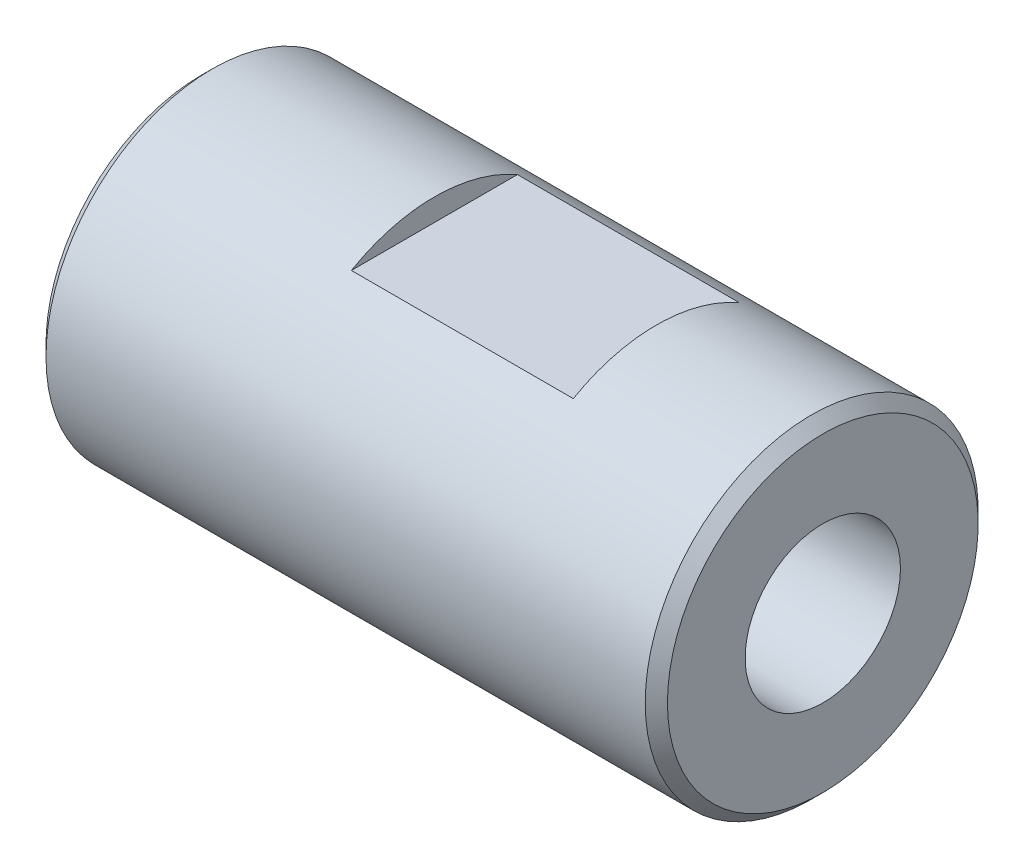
ISO-10303-21;
HEADER;
FILE_DESCRIPTION(('STEP AP214'),'2;1');
FILE_NAME('part.step','',(''),(''),'','','');
FILE_SCHEMA(('AUTOMOTIVE_DESIGN { 1 0 10303 214 1 1 1 1 }'));
ENDSEC;
DATA;
#1=APPLICATION_CONTEXT('core data for automotive mechanical design processes');
#2=APPLICATION_PROTOCOL_DEFINITION('international standard','automotive_design',2000,#1);
#3=PRODUCT_CONTEXT('',#1,'mechanical');
#4=PRODUCT('Part','Part','',(#3));
#5=PRODUCT_RELATED_PRODUCT_CATEGORY('part','',(#4));
#6=PRODUCT_DEFINITION_FORMATION('','',#4);
#7=PRODUCT_DEFINITION_CONTEXT('part definition',#1,'design');
#8=PRODUCT_DEFINITION('design','',#6,#7);
#9=PRODUCT_DEFINITION_SHAPE('','',#8);
#10=(LENGTH_UNIT() NAMED_UNIT(*) SI_UNIT(.MILLI.,.METRE.));
#11=(NAMED_UNIT(*) PLANE_ANGLE_UNIT() SI_UNIT($,.RADIAN.));
#12=(NAMED_UNIT(*) SI_UNIT($,.STERADIAN.) SOLID_ANGLE_UNIT());
#13=UNCERTAINTY_MEASURE_WITH_UNIT(LENGTH_MEASURE(1.E-05),#10,'distance_accuracy_value','');
#14=(GEOMETRIC_REPRESENTATION_CONTEXT(3) GLOBAL_UNCERTAINTY_ASSIGNED_CONTEXT((#13)) GLOBAL_UNIT_ASSIGNED_CONTEXT((#10,
#11,#12)) REPRESENTATION_CONTEXT('',''));
#15=CARTESIAN_POINT('',(0.,0.,0.));
#16=DIRECTION('',(0.,0.,1.));
#17=DIRECTION('',(1.,0.,0.));
#18=AXIS2_PLACEMENT_3D('',#15,#16,#17);
#19=CARTESIAN_POINT('',(-14.6311083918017,0.,0.));
#20=DIRECTION('',(-1.,0.,0.));
#21=DIRECTION('',(0.,0.,1.));
#22=AXIS2_PLACEMENT_3D('',#19,#20,#21);
#23=CYLINDRICAL_SURFACE('',#22,8.5);
#24=CARTESIAN_POINT('',(32.,0.,0.));
#25=DIRECTION('',(-1.,0.,0.));
#26=DIRECTION('',(0.,0.,1.));
#27=AXIS2_PLACEMENT_3D('',#24,#25,#26);
#28=CIRCLE('',#27,8.5);
#29=CARTESIAN_POINT('',(32.,0.,8.5));
#30=VERTEX_POINT('',#29);
#31=EDGE_CURVE('E19',#30,#30,#28,.F.);
#32=ORIENTED_EDGE('',*,*,#31,.T.);
#33=EDGE_LOOP('',(#32));
#34=FACE_BOUND('',#33,.T.);
#35=CARTESIAN_POINT('',(24.,0.,0.));
#36=DIRECTION('',(-1.,0.,0.));
#37=DIRECTION('',(0.,0.,1.));
#38=AXIS2_PLACEMENT_3D('',#35,#36,#37);
#39=CIRCLE('',#38,8.5);
#40=CARTESIAN_POINT('',(24.,0.,8.5));
#41=VERTEX_POINT('',#40);
#42=EDGE_CURVE('E96',#41,#41,#39,.T.);
#43=ORIENTED_EDGE('',*,*,#42,.T.);
#44=EDGE_LOOP('',(#43));
#45=FACE_BOUND('',#44,.T.);
#46=ADVANCED_FACE('F16',(#34,#45),#23,.F.);
#47=CARTESIAN_POINT('',(32.,8.5,0.));
#48=DIRECTION('',(1.,0.,0.));
#49=DIRECTION('',(0.,0.,-1.));
#50=AXIS2_PLACEMENT_3D('',#47,#48,#49);
#51=PLANE('',#50);
#52=ORIENTED_EDGE('',*,*,#31,.F.);
#53=EDGE_LOOP('',(#52));
#54=FACE_BOUND('',#53,.T.);
#55=CARTESIAN_POINT('',(32.,0.,0.));
#56=DIRECTION('',(1.,0.,0.));
#57=DIRECTION('',(0.,0.,-1.));
#58=AXIS2_PLACEMENT_3D('',#55,#56,#57);
#59=CIRCLE('',#58,6.99999999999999);
#60=CARTESIAN_POINT('',(32.,0.,-6.99999999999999));
#61=VERTEX_POINT('',#60);
#62=EDGE_CURVE('E94',#61,#61,#59,.T.);
#63=ORIENTED_EDGE('',*,*,#62,.T.);
#64=EDGE_LOOP('',(#63));
#65=FACE_BOUND('',#64,.T.);
#66=ADVANCED_FACE('F104',(#54,#65),#51,.F.);
#67=CARTESIAN_POINT('',(24.,0.,0.));
#68=DIRECTION('',(-1.,0.,0.));
#69=DIRECTION('',(0.,0.,1.));
#70=AXIS2_PLACEMENT_3D('',#67,#68,#69);
#71=PLANE('',#70);
#72=ORIENTED_EDGE('',*,*,#42,.F.);
#73=EDGE_LOOP('',(#72));
#74=FACE_BOUND('',#73,.T.);
#75=CARTESIAN_POINT('',(24.,0.,0.));
#76=DIRECTION('',(-1.,0.,0.));
#77=DIRECTION('',(0.,0.,1.));
#78=AXIS2_PLACEMENT_3D('',#75,#76,#77);
#79=CIRCLE('',#78,7.25);
#80=CARTESIAN_POINT('',(24.,0.,7.25));
#81=VERTEX_POINT('',#80);
#82=EDGE_CURVE('E91',#81,#81,#79,.T.);
#83=ORIENTED_EDGE('',*,*,#82,.T.);
#84=EDGE_LOOP('',(#83));
#85=FACE_BOUND('',#84,.T.);
#86=ADVANCED_FACE('F107',(#74,#85),#71,.F.);
#87=CARTESIAN_POINT('',(56.,0.,0.));
#88=DIRECTION('',(1.,0.,0.));
#89=DIRECTION('',(0.,0.,-1.));
#90=AXIS2_PLACEMENT_3D('',#87,#88,#89);
#91=CYLINDRICAL_SURFACE('',#90,6.99999999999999);
#92=ORIENTED_EDGE('',*,*,#62,.F.);
#93=EDGE_LOOP('',(#92));
#94=FACE_BOUND('',#93,.T.);
#95=CARTESIAN_POINT('',(56.,0.,0.));
#96=DIRECTION('',(1.,0.,0.));
#97=DIRECTION('',(0.,0.,-1.));
#98=AXIS2_PLACEMENT_3D('',#95,#96,#97);
#99=CIRCLE('',#98,6.99999999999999);
#100=CARTESIAN_POINT('',(56.,0.,-6.99999999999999));
#101=VERTEX_POINT('',#100);
#102=EDGE_CURVE('E88',#101,#101,#99,.T.);
#103=ORIENTED_EDGE('',*,*,#102,.T.);
#104=EDGE_LOOP('',(#103));
#105=FACE_BOUND('',#104,.T.);
#106=ADVANCED_FACE('F110',(#94,#105),#91,.F.);
#107=CARTESIAN_POINT('',(0.,0.,0.));
#108=DIRECTION('',(-1.,0.,0.));
#109=DIRECTION('',(0.,0.,1.));
#110=AXIS2_PLACEMENT_3D('',#107,#108,#109);
#111=CYLINDRICAL_SURFACE('',#110,7.25);
#112=ORIENTED_EDGE('',*,*,#82,.F.);
#113=EDGE_LOOP('',(#112));
#114=FACE_BOUND('',#113,.T.);
#115=CARTESIAN_POINT('',(0.,0.,0.));
#116=DIRECTION('',(-1.,0.,0.));
#117=DIRECTION('',(0.,0.,1.));
#118=AXIS2_PLACEMENT_3D('',#115,#116,#117);
#119=CIRCLE('',#118,7.25);
#120=CARTESIAN_POINT('',(0.,0.,7.25));
#121=VERTEX_POINT('',#120);
#122=EDGE_CURVE('E61',#121,#121,#119,.T.);
#123=ORIENTED_EDGE('',*,*,#122,.T.);
#124=EDGE_LOOP('',(#123));
#125=FACE_BOUND('',#124,.T.);
#126=ADVANCED_FACE('F113',(#114,#125),#111,.F.);
#127=CARTESIAN_POINT('',(56.,15.,0.));
#128=DIRECTION('',(-1.,0.,0.));
#129=DIRECTION('',(0.,0.,1.));
#130=AXIS2_PLACEMENT_3D('',#127,#128,#129);
#131=PLANE('',#130);
#132=ORIENTED_EDGE('',*,*,#102,.F.);
#133=EDGE_LOOP('',(#132));
#134=FACE_BOUND('',#133,.T.);
#135=CARTESIAN_POINT('',(56.,0.,0.));
#136=DIRECTION('',(-1.,0.,0.));
#137=DIRECTION('',(0.,0.,1.));
#138=AXIS2_PLACEMENT_3D('',#135,#136,#137);
#139=CIRCLE('',#138,14.);
#140=CARTESIAN_POINT('',(56.,0.,14.));
#141=VERTEX_POINT('',#140);
#142=EDGE_CURVE('E82',#141,#141,#139,.T.);
#143=ORIENTED_EDGE('',*,*,#142,.F.);
#144=EDGE_LOOP('',(#143));
#145=FACE_BOUND('',#144,.T.);
#146=ADVANCED_FACE('F117',(#134,#145),#131,.F.);
#147=CARTESIAN_POINT('',(0.,15.,0.));
#148=DIRECTION('',(1.,0.,0.));
#149=DIRECTION('',(0.,0.,-1.));
#150=AXIS2_PLACEMENT_3D('',#147,#148,#149);
#151=PLANE('',#150);
#152=ORIENTED_EDGE('',*,*,#122,.F.);
#153=EDGE_LOOP('',(#152));
#154=FACE_BOUND('',#153,.T.);
#155=CARTESIAN_POINT('',(0.,0.,0.));
#156=DIRECTION('',(1.,0.,0.));
#157=DIRECTION('',(0.,1.,0.));
#158=AXIS2_PLACEMENT_3D('',#155,#156,#157);
#159=CIRCLE('',#158,14.);
#160=CARTESIAN_POINT('',(0.,14.,0.));
#161=VERTEX_POINT('',#160);
#162=EDGE_CURVE('E75',#161,#161,#159,.T.);
#163=ORIENTED_EDGE('',*,*,#162,.F.);
#164=EDGE_LOOP('',(#163));
#165=FACE_BOUND('',#164,.T.);
#166=ADVANCED_FACE('F120',(#154,#165),#151,.F.);
#167=CARTESIAN_POINT('',(21.,-20.5210315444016,-25.));
#168=DIRECTION('',(-1.,0.,0.));
#169=DIRECTION('',(0.,0.,1.));
#170=AXIS2_PLACEMENT_3D('',#167,#168,#169);
#171=PLANE('',#170);
#172=CARTESIAN_POINT('',(21.,0.,0.));
#173=DIRECTION('',(-1.,0.,0.));
#174=DIRECTION('',(0.,0.,1.));
#175=AXIS2_PLACEMENT_3D('',#172,#173,#174);
#176=CIRCLE('',#175,15.);
#177=CARTESIAN_POINT('',(21.,-13.,-7.48331477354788));
#178=VERTEX_POINT('',#177);
#179=CARTESIAN_POINT('',(21.,-13.,7.48331477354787));
#180=VERTEX_POINT('',#179);
#181=EDGE_CURVE('E58',#178,#180,#176,.T.);
#182=ORIENTED_EDGE('',*,*,#181,.F.);
#183=DIRECTION('',(0.,0.,1.));
#184=VECTOR('',#183,1.);
#185=CARTESIAN_POINT('',(21.,-13.,-25.));
#186=LINE('',#185,#184);
#187=EDGE_CURVE('E53',#178,#180,#186,.T.);
#188=ORIENTED_EDGE('',*,*,#187,.T.);
#189=EDGE_LOOP('',(#182,#188));
#190=FACE_BOUND('',#189,.T.);
#191=ADVANCED_FACE('F56',(#190),#171,.F.);
#192=CARTESIAN_POINT('',(21.,-13.,-25.));
#193=DIRECTION('',(0.,1.,0.));
#194=DIRECTION('',(-1.,0.,0.));
#195=AXIS2_PLACEMENT_3D('',#192,#193,#194);
#196=PLANE('',#195);
#197=DIRECTION('',(-1.,0.,0.));
#198=VECTOR('',#197,1.);
#199=CARTESIAN_POINT('',(-14.6311083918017,-13.,7.48331477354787));
#200=LINE('',#199,#198);
#201=CARTESIAN_POINT('',(41.,-13.,7.48331477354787));
#202=VERTEX_POINT('',#201);
#203=EDGE_CURVE('E64',#180,#202,#200,.F.);
#204=ORIENTED_EDGE('',*,*,#203,.F.);
#205=ORIENTED_EDGE('',*,*,#187,.F.);
#206=DIRECTION('',(-1.,0.,0.));
#207=VECTOR('',#206,1.);
#208=CARTESIAN_POINT('',(-14.6311083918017,-13.,-7.48331477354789));
#209=LINE('',#208,#207);
#210=CARTESIAN_POINT('',(41.,-13.,-7.48331477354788));
#211=VERTEX_POINT('',#210);
#212=EDGE_CURVE('E73',#211,#178,#209,.T.);
#213=ORIENTED_EDGE('',*,*,#212,.F.);
#214=DIRECTION('',(0.,0.,-1.));
#215=VECTOR('',#214,1.);
#216=CARTESIAN_POINT('',(41.,-13.,-25.));
#217=LINE('',#216,#215);
#218=EDGE_CURVE('E60',#211,#202,#217,.F.);
#219=ORIENTED_EDGE('',*,*,#218,.T.);
#220=EDGE_LOOP('',(#204,#205,#213,#219));
#221=FACE_BOUND('',#220,.T.);
#222=ADVANCED_FACE('F65',(#221),#196,.F.);
#223=CARTESIAN_POINT('',(41.,-20.5210315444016,-25.));
#224=DIRECTION('',(1.,0.,0.));
#225=DIRECTION('',(0.,0.,-1.));
#226=AXIS2_PLACEMENT_3D('',#223,#224,#225);
#227=PLANE('',#226);
#228=CARTESIAN_POINT('',(41.,0.,0.));
#229=DIRECTION('',(-1.,0.,0.));
#230=DIRECTION('',(0.,0.,1.));
#231=AXIS2_PLACEMENT_3D('',#228,#229,#230);
#232=CIRCLE('',#231,15.);
#233=EDGE_CURVE('E70',#202,#211,#232,.F.);
#234=ORIENTED_EDGE('',*,*,#233,.F.);
#235=ORIENTED_EDGE('',*,*,#218,.F.);
#236=EDGE_LOOP('',(#234,#235));
#237=FACE_BOUND('',#236,.T.);
#238=ADVANCED_FACE('F163',(#237),#227,.F.);
#239=CARTESIAN_POINT('',(41.,20.5210315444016,-25.));
#240=DIRECTION('',(1.,0.,0.));
#241=DIRECTION('',(0.,0.,-1.));
#242=AXIS2_PLACEMENT_3D('',#239,#240,#241);
#243=PLANE('',#242);
#244=CARTESIAN_POINT('',(41.,0.,0.));
#245=DIRECTION('',(-1.,0.,0.));
#246=DIRECTION('',(0.,0.,1.));
#247=AXIS2_PLACEMENT_3D('',#244,#245,#246);
#248=CIRCLE('',#247,15.);
#249=CARTESIAN_POINT('',(41.,13.,-7.48331477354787));
#250=VERTEX_POINT('',#249);
#251=CARTESIAN_POINT('',(41.,13.,7.48331477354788));
#252=VERTEX_POINT('',#251);
#253=EDGE_CURVE('E160',#250,#252,#248,.F.);
#254=ORIENTED_EDGE('',*,*,#253,.F.);
#255=DIRECTION('',(0.,0.,1.));
#256=VECTOR('',#255,1.);
#257=CARTESIAN_POINT('',(41.,13.,-25.));
#258=LINE('',#257,#256);
#259=EDGE_CURVE('E85',#250,#252,#258,.T.);
#260=ORIENTED_EDGE('',*,*,#259,.T.);
#261=EDGE_LOOP('',(#254,#260));
#262=FACE_BOUND('',#261,.T.);
#263=ADVANCED_FACE('F170',(#262),#243,.F.);
#264=CARTESIAN_POINT('',(21.,20.5210315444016,-25.));
#265=DIRECTION('',(-1.,0.,0.));
#266=DIRECTION('',(0.,0.,1.));
#267=AXIS2_PLACEMENT_3D('',#264,#265,#266);
#268=PLANE('',#267);
#269=CARTESIAN_POINT('',(21.,0.,0.));
#270=DIRECTION('',(-1.,0.,0.));
#271=DIRECTION('',(0.,0.,1.));
#272=AXIS2_PLACEMENT_3D('',#269,#270,#271);
#273=CIRCLE('',#272,15.);
#274=CARTESIAN_POINT('',(21.,13.,7.48331477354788));
#275=VERTEX_POINT('',#274);
#276=CARTESIAN_POINT('',(21.,13.,-7.48331477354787));
#277=VERTEX_POINT('',#276);
#278=EDGE_CURVE('E153',#275,#277,#273,.T.);
#279=ORIENTED_EDGE('',*,*,#278,.F.);
#280=DIRECTION('',(0.,0.,1.));
#281=VECTOR('',#280,1.);
#282=CARTESIAN_POINT('',(21.,13.,-25.));
#283=LINE('',#282,#281);
#284=EDGE_CURVE('E33',#275,#277,#283,.F.);
#285=ORIENTED_EDGE('',*,*,#284,.T.);
#286=EDGE_LOOP('',(#279,#285));
#287=FACE_BOUND('',#286,.T.);
#288=ADVANCED_FACE('F137',(#287),#268,.F.);
#289=CARTESIAN_POINT('',(21.,13.,-25.));
#290=DIRECTION('',(0.,-1.,0.));
#291=DIRECTION('',(1.,0.,0.));
#292=AXIS2_PLACEMENT_3D('',#289,#290,#291);
#293=PLANE('',#292);
#294=DIRECTION('',(-1.,0.,0.));
#295=VECTOR('',#294,1.);
#296=CARTESIAN_POINT('',(-14.6311083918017,13.,-7.48331477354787));
#297=LINE('',#296,#295);
#298=EDGE_CURVE('E155',#277,#250,#297,.F.);
#299=ORIENTED_EDGE('',*,*,#298,.F.);
#300=ORIENTED_EDGE('',*,*,#284,.F.);
#301=DIRECTION('',(-1.,0.,0.));
#302=VECTOR('',#301,1.);
#303=CARTESIAN_POINT('',(-14.6311083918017,13.,7.48331477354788));
#304=LINE('',#303,#302);
#305=EDGE_CURVE('E157',#252,#275,#304,.T.);
#306=ORIENTED_EDGE('',*,*,#305,.F.);
#307=ORIENTED_EDGE('',*,*,#259,.F.);
#308=EDGE_LOOP('',(#299,#300,#306,#307));
#309=FACE_BOUND('',#308,.T.);
#310=ADVANCED_FACE('F127',(#309),#293,.F.);
#311=CARTESIAN_POINT('',(55.,0.,0.));
#312=DIRECTION('',(-1.,0.,0.));
#313=DIRECTION('',(0.,0.,1.));
#314=AXIS2_PLACEMENT_3D('',#311,#312,#313);
#315=CONICAL_SURFACE('',#314,15.,0.785398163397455);
#316=CARTESIAN_POINT('',(55.,0.,0.));
#317=DIRECTION('',(-1.,0.,0.));
#318=DIRECTION('',(0.,0.,1.));
#319=AXIS2_PLACEMENT_3D('',#316,#317,#318);
#320=CIRCLE('',#319,15.);
#321=CARTESIAN_POINT('',(55.,0.,15.));
#322=VERTEX_POINT('',#321);
#323=EDGE_CURVE('E25',#322,#322,#320,.T.);
#324=ORIENTED_EDGE('',*,*,#323,.F.);
#325=EDGE_LOOP('',(#324));
#326=FACE_BOUND('',#325,.T.);
#327=ORIENTED_EDGE('',*,*,#142,.T.);
#328=EDGE_LOOP('',(#327));
#329=FACE_BOUND('',#328,.T.);
#330=ADVANCED_FACE('F124',(#326,#329),#315,.T.);
#331=CARTESIAN_POINT('',(1.00000000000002,0.,0.));
#332=DIRECTION('',(1.,0.,0.));
#333=DIRECTION('',(0.,1.,0.));
#334=AXIS2_PLACEMENT_3D('',#331,#332,#333);
#335=CONICAL_SURFACE('',#334,15.,0.785398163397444);
#336=CARTESIAN_POINT('',(1.00000000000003,0.,0.));
#337=DIRECTION('',(-1.,0.,0.));
#338=DIRECTION('',(0.,0.,1.));
#339=AXIS2_PLACEMENT_3D('',#336,#337,#338);
#340=CIRCLE('',#339,15.);
#341=CARTESIAN_POINT('',(1.00000000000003,0.,15.));
#342=VERTEX_POINT('',#341);
#343=EDGE_CURVE('E11',#342,#342,#340,.F.);
#344=ORIENTED_EDGE('',*,*,#343,.F.);
#345=EDGE_LOOP('',(#344));
#346=FACE_BOUND('',#345,.T.);
#347=ORIENTED_EDGE('',*,*,#162,.T.);
#348=EDGE_LOOP('',(#347));
#349=FACE_BOUND('',#348,.T.);
#350=ADVANCED_FACE('F126',(#346,#349),#335,.T.);
#351=CARTESIAN_POINT('',(-14.6311083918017,0.,0.));
#352=DIRECTION('',(-1.,0.,0.));
#353=DIRECTION('',(0.,0.,1.));
#354=AXIS2_PLACEMENT_3D('',#351,#352,#353);
#355=CYLINDRICAL_SURFACE('',#354,15.);
#356=ORIENTED_EDGE('',*,*,#343,.T.);
#357=EDGE_LOOP('',(#356));
#358=FACE_BOUND('',#357,.T.);
#359=ORIENTED_EDGE('',*,*,#323,.T.);
#360=EDGE_LOOP('',(#359));
#361=FACE_BOUND('',#360,.T.);
#362=ORIENTED_EDGE('',*,*,#278,.T.);
#363=ORIENTED_EDGE('',*,*,#298,.T.);
#364=ORIENTED_EDGE('',*,*,#253,.T.);
#365=ORIENTED_EDGE('',*,*,#305,.T.);
#366=EDGE_LOOP('',(#362,#363,#364,#365));
#367=FACE_BOUND('',#366,.T.);
#368=ORIENTED_EDGE('',*,*,#203,.T.);
#369=ORIENTED_EDGE('',*,*,#233,.T.);
#370=ORIENTED_EDGE('',*,*,#212,.T.);
#371=ORIENTED_EDGE('',*,*,#181,.T.);
#372=EDGE_LOOP('',(#368,#369,#370,#371));
#373=FACE_BOUND('',#372,.T.);
#374=ADVANCED_FACE('F72',(#358,#361,#367,#373),#355,.T.);
#375=CLOSED_SHELL('',(#46,#66,#86,#106,#126,#146,#166,#191,#222,#238,#263,#288,#310,#330,#350,#374));
#376=MANIFOLD_SOLID_BREP('B1',#375);
#377=ADVANCED_BREP_SHAPE_REPRESENTATION('',(#18,#376),#14);
#378=SHAPE_DEFINITION_REPRESENTATION(#9,#377);
ENDSEC;
END-ISO-10303-21;
